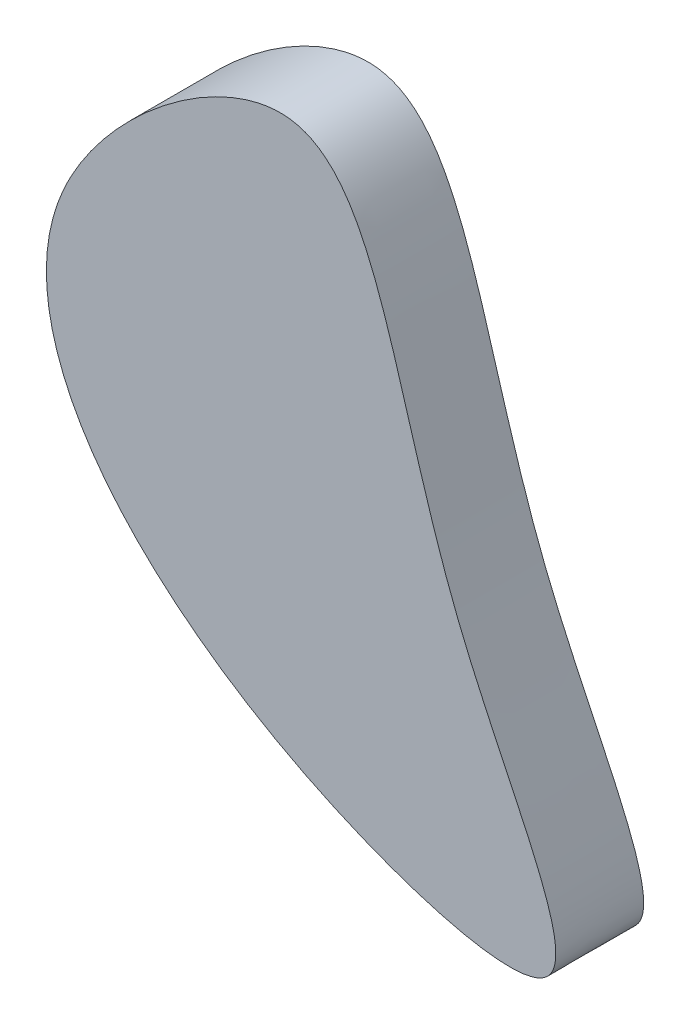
ISO-10303-21;
HEADER;
FILE_DESCRIPTION(('STEP AP214'),'2;1');
FILE_NAME('part.step','',(''),(''),'','','');
FILE_SCHEMA(('AUTOMOTIVE_DESIGN { 1 0 10303 214 1 1 1 1 }'));
ENDSEC;
DATA;
#1=APPLICATION_CONTEXT('core data for automotive mechanical design processes');
#2=APPLICATION_PROTOCOL_DEFINITION('international standard','automotive_design',2000,#1);
#3=PRODUCT_CONTEXT('',#1,'mechanical');
#4=PRODUCT('Part','Part','',(#3));
#5=PRODUCT_RELATED_PRODUCT_CATEGORY('part','',(#4));
#6=PRODUCT_DEFINITION_FORMATION('','',#4);
#7=PRODUCT_DEFINITION_CONTEXT('part definition',#1,'design');
#8=PRODUCT_DEFINITION('design','',#6,#7);
#9=PRODUCT_DEFINITION_SHAPE('','',#8);
#10=(LENGTH_UNIT() NAMED_UNIT(*) SI_UNIT(.MILLI.,.METRE.));
#11=(NAMED_UNIT(*) PLANE_ANGLE_UNIT() SI_UNIT($,.RADIAN.));
#12=(NAMED_UNIT(*) SI_UNIT($,.STERADIAN.) SOLID_ANGLE_UNIT());
#13=UNCERTAINTY_MEASURE_WITH_UNIT(LENGTH_MEASURE(1.E-05),#10,'distance_accuracy_value','');
#14=(GEOMETRIC_REPRESENTATION_CONTEXT(3) GLOBAL_UNCERTAINTY_ASSIGNED_CONTEXT((#13)) GLOBAL_UNIT_ASSIGNED_CONTEXT((#10,
#11,#12)) REPRESENTATION_CONTEXT('',''));
#15=CARTESIAN_POINT('',(0.,0.,0.));
#16=DIRECTION('',(0.,0.,1.));
#17=DIRECTION('',(1.,0.,0.));
#18=AXIS2_PLACEMENT_3D('',#15,#16,#17);
#19=CARTESIAN_POINT('',(0.,0.,10.));
#20=CARTESIAN_POINT('',(-7.57095188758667,-17.2288216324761,10.));
#21=CARTESIAN_POINT('',(15.8097508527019,-43.1645420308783,10.));
#22=CARTESIAN_POINT('',(66.0008745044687,-56.771265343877,10.));
#23=CARTESIAN_POINT('',(38.2704928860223,-15.346367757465,10.));
#24=CARTESIAN_POINT('',(34.9294454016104,34.3103151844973,10.));
#25=CARTESIAN_POINT('',(4.48176915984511,10.1989290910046,10.));
#26=CARTESIAN_POINT('',(0.,0.,10.));
#27=B_SPLINE_CURVE_WITH_KNOTS('',3,(#19,#20,#21,#22,#23,#24,#25,#26),.UNSPECIFIED.,.T.,.F.,(4,1,
1,1,1,4),(-0.604816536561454,0.0295020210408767,0.328522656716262,0.69941210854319,
1.22392900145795,1.59942595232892),.UNSPECIFIED.);
#28=DIRECTION('',(0.,0.,-1.));
#29=VECTOR('',#28,1.);
#30=SURFACE_OF_LINEAR_EXTRUSION('',#27,#29);
#31=CARTESIAN_POINT('',(0.,0.,10.));
#32=VERTEX_POINT('',#31);
#33=EDGE_CURVE('E10',#32,#32,#27,.T.);
#34=ORIENTED_EDGE('',*,*,#33,.F.);
#35=EDGE_LOOP('',(#34));
#36=FACE_BOUND('',#35,.T.);
#37=CARTESIAN_POINT('',(0.,0.,0.));
#38=CARTESIAN_POINT('',(-7.57095188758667,-17.2288216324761,0.));
#39=CARTESIAN_POINT('',(15.8097508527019,-43.1645420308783,0.));
#40=CARTESIAN_POINT('',(66.0008745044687,-56.771265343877,0.));
#41=CARTESIAN_POINT('',(38.2704928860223,-15.346367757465,0.));
#42=CARTESIAN_POINT('',(34.9294454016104,34.3103151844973,0.));
#43=CARTESIAN_POINT('',(4.48176915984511,10.1989290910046,0.));
#44=CARTESIAN_POINT('',(0.,0.,0.));
#45=B_SPLINE_CURVE_WITH_KNOTS('',3,(#37,#38,#39,#40,#41,#42,#43,#44),.UNSPECIFIED.,.T.,.F.,(4,1,
1,1,1,4),(-0.604816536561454,0.0295020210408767,0.328522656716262,0.69941210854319,
1.22392900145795,1.59942595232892),.UNSPECIFIED.);
#46=CARTESIAN_POINT('',(0.,0.,0.));
#47=VERTEX_POINT('',#46);
#48=EDGE_CURVE('E40',#47,#47,#45,.T.);
#49=ORIENTED_EDGE('',*,*,#48,.T.);
#50=EDGE_LOOP('',(#49));
#51=FACE_BOUND('',#50,.T.);
#52=ADVANCED_FACE('F31',(#36,#51),#30,.F.);
#53=CARTESIAN_POINT('',(54.1618391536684,-40.1402370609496,10.));
#54=DIRECTION('',(0.,0.,1.));
#55=DIRECTION('',(1.,0.,0.));
#56=AXIS2_PLACEMENT_3D('',#53,#54,#55);
#57=PLANE('',#56);
#58=ORIENTED_EDGE('',*,*,#33,.T.);
#59=EDGE_LOOP('',(#58));
#60=FACE_BOUND('',#59,.T.);
#61=ADVANCED_FACE('F54',(#60),#57,.T.);
#62=CARTESIAN_POINT('',(54.1618391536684,-40.1402370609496,0.));
#63=DIRECTION('',(0.,0.,1.));
#64=DIRECTION('',(1.,0.,0.));
#65=AXIS2_PLACEMENT_3D('',#62,#63,#64);
#66=PLANE('',#65);
#67=ORIENTED_EDGE('',*,*,#48,.F.);
#68=EDGE_LOOP('',(#67));
#69=FACE_BOUND('',#68,.T.);
#70=ADVANCED_FACE('F52',(#69),#66,.F.);
#71=CLOSED_SHELL('',(#52,#61,#70));
#72=MANIFOLD_SOLID_BREP('B2',#71);
#73=ADVANCED_BREP_SHAPE_REPRESENTATION('',(#18,#72),#14);
#74=SHAPE_DEFINITION_REPRESENTATION(#9,#73);
ENDSEC;
END-ISO-10303-21;
